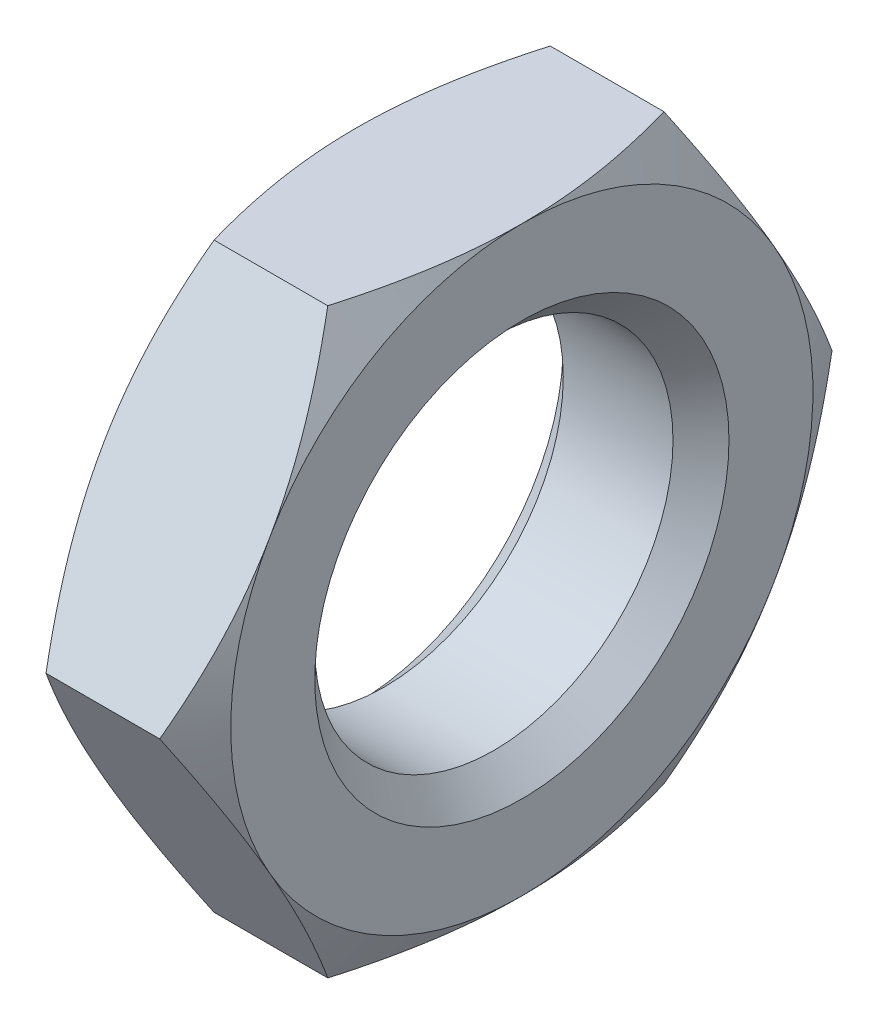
from build123d import *

# Parameters (mm, degrees)
SKETCH1_R      = 4
EXTRUDE1_DEPTH = 3.7
CHAMFER1_SIZE  = 0.625


with BuildPart() as part:
    # Sketch1 → Extrude1 (new body)
    with BuildSketch(Plane(origin=(0, 0, 0), x_dir=(0, 0, -1), z_dir=(1, 0, 0))):
        Polygon((3.75277675, 6.5), (-3.75277675, 6.5), (-7.505553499, 0), (-3.75277675, -6.5), (3.75277675, -6.5), (7.505553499, 0), align=None)
        Circle(SKETCH1_R, mode=Mode.SUBTRACT)
    extrude(amount=EXTRUDE1_DEPTH)

    # Sketch2 → Cut-Revolve1 (revolve, cut)
    with BuildSketch(Plane.XY):
        Polygon((3.7, 6.5), (3.7, 26), (0, 26), (0, 6.5), (1.85, 9.704293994), align=None)
    revolve(axis=Axis((3.7, 0, 0), (-1, 0, 0)), mode=Mode.SUBTRACT)

    # Chamfer1
    chamfer1_edges = [part.edges().sort_by_distance(p)[0] for p in [
        (0, 0, 4),
        (3.7, 0, 4),
    ]]
    chamfer(chamfer1_edges, length=CHAMFER1_SIZE)


solid = part.part
